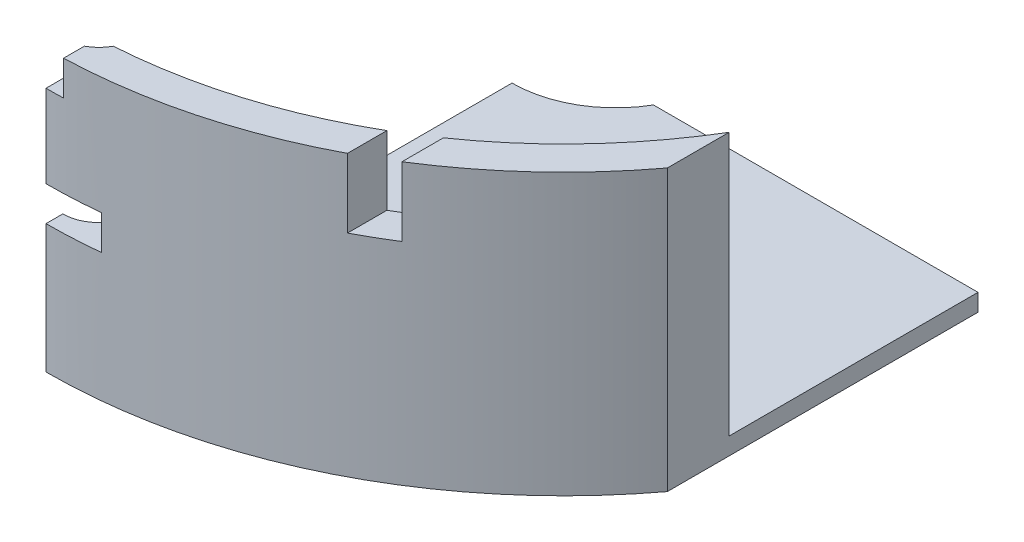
ISO-10303-21;
HEADER;
FILE_DESCRIPTION(('STEP AP214'),'2;1');
FILE_NAME('part.step','',(''),(''),'','','');
FILE_SCHEMA(('AUTOMOTIVE_DESIGN { 1 0 10303 214 1 1 1 1 }'));
ENDSEC;
DATA;
#1=APPLICATION_CONTEXT('core data for automotive mechanical design processes');
#2=APPLICATION_PROTOCOL_DEFINITION('international standard','automotive_design',2000,#1);
#3=PRODUCT_CONTEXT('',#1,'mechanical');
#4=PRODUCT('Part','Part','',(#3));
#5=PRODUCT_RELATED_PRODUCT_CATEGORY('part','',(#4));
#6=PRODUCT_DEFINITION_FORMATION('','',#4);
#7=PRODUCT_DEFINITION_CONTEXT('part definition',#1,'design');
#8=PRODUCT_DEFINITION('design','',#6,#7);
#9=PRODUCT_DEFINITION_SHAPE('','',#8);
#10=(LENGTH_UNIT() NAMED_UNIT(*) SI_UNIT(.MILLI.,.METRE.));
#11=(NAMED_UNIT(*) PLANE_ANGLE_UNIT() SI_UNIT($,.RADIAN.));
#12=(NAMED_UNIT(*) SI_UNIT($,.STERADIAN.) SOLID_ANGLE_UNIT());
#13=UNCERTAINTY_MEASURE_WITH_UNIT(LENGTH_MEASURE(1.E-05),#10,'distance_accuracy_value','');
#14=(GEOMETRIC_REPRESENTATION_CONTEXT(3) GLOBAL_UNCERTAINTY_ASSIGNED_CONTEXT((#13)) GLOBAL_UNIT_ASSIGNED_CONTEXT((#10,
#11,#12)) REPRESENTATION_CONTEXT('',''));
#15=CARTESIAN_POINT('',(0.,0.,0.));
#16=DIRECTION('',(0.,0.,1.));
#17=DIRECTION('',(1.,0.,0.));
#18=AXIS2_PLACEMENT_3D('',#15,#16,#17);
#19=CARTESIAN_POINT('',(0.,5.,0.));
#20=DIRECTION('',(0.,-1.,0.));
#21=DIRECTION('',(0.,0.,-1.));
#22=AXIS2_PLACEMENT_3D('',#19,#20,#21);
#23=CYLINDRICAL_SURFACE('',#22,150.);
#24=DIRECTION('',(0.,-1.,0.));
#25=VECTOR('',#24,1.);
#26=CARTESIAN_POINT('',(0.,5.,150.));
#27=LINE('',#26,#25);
#28=CARTESIAN_POINT('',(0.,0.,150.));
#29=VERTEX_POINT('',#28);
#30=CARTESIAN_POINT('',(0.,37.2404509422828,150.));
#31=VERTEX_POINT('',#30);
#32=EDGE_CURVE('E187',#29,#31,#27,.F.);
#33=ORIENTED_EDGE('',*,*,#32,.F.);
#34=CARTESIAN_POINT('',(0.,0.,0.));
#35=DIRECTION('',(0.,1.,0.));
#36=DIRECTION('',(0.,0.,1.));
#37=AXIS2_PLACEMENT_3D('',#34,#35,#36);
#38=CIRCLE('',#37,150.);
#39=CARTESIAN_POINT('',(120.,0.,89.9999999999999));
#40=VERTEX_POINT('',#39);
#41=EDGE_CURVE('E201',#29,#40,#38,.T.);
#42=ORIENTED_EDGE('',*,*,#41,.T.);
#43=DIRECTION('',(0.,1.,0.));
#44=VECTOR('',#43,1.);
#45=CARTESIAN_POINT('',(120.,-5.,89.9999999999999));
#46=LINE('',#45,#44);
#47=CARTESIAN_POINT('',(120.,81.2,89.9999999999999));
#48=VERTEX_POINT('',#47);
#49=EDGE_CURVE('E243',#40,#48,#46,.T.);
#50=ORIENTED_EDGE('',*,*,#49,.T.);
#51=CARTESIAN_POINT('',(0.,81.2,0.));
#52=DIRECTION('',(0.,1.,0.));
#53=DIRECTION('',(0.,0.,1.));
#54=AXIS2_PLACEMENT_3D('',#51,#52,#53);
#55=CIRCLE('',#54,150.);
#56=CARTESIAN_POINT('',(80.,81.2,126.885775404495));
#57=VERTEX_POINT('',#56);
#58=EDGE_CURVE('E323',#57,#48,#55,.T.);
#59=ORIENTED_EDGE('',*,*,#58,.F.);
#60=DIRECTION('',(0.,-1.,0.));
#61=VECTOR('',#60,1.);
#62=CARTESIAN_POINT('',(80.,4.99999999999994,126.885775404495));
#63=LINE('',#62,#61);
#64=CARTESIAN_POINT('',(80.,61.2,126.885775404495));
#65=VERTEX_POINT('',#64);
#66=EDGE_CURVE('E333',#65,#57,#63,.F.);
#67=ORIENTED_EDGE('',*,*,#66,.F.);
#68=CARTESIAN_POINT('',(0.,61.2,0.));
#69=DIRECTION('',(0.,1.,0.));
#70=DIRECTION('',(0.,0.,1.));
#71=AXIS2_PLACEMENT_3D('',#68,#69,#70);
#72=CIRCLE('',#71,150.);
#73=CARTESIAN_POINT('',(70.,61.2,132.664991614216));
#74=VERTEX_POINT('',#73);
#75=EDGE_CURVE('E335',#74,#65,#72,.T.);
#76=ORIENTED_EDGE('',*,*,#75,.F.);
#77=DIRECTION('',(0.,-1.,0.));
#78=VECTOR('',#77,1.);
#79=CARTESIAN_POINT('',(70.,5.,132.664991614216));
#80=LINE('',#79,#78);
#81=CARTESIAN_POINT('',(70.,81.2,132.664991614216));
#82=VERTEX_POINT('',#81);
#83=EDGE_CURVE('E336',#82,#74,#80,.T.);
#84=ORIENTED_EDGE('',*,*,#83,.F.);
#85=CARTESIAN_POINT('',(5.,81.2,149.916643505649));
#86=VERTEX_POINT('',#85);
#87=EDGE_CURVE('E324',#86,#82,#55,.T.);
#88=ORIENTED_EDGE('',*,*,#87,.F.);
#89=DIRECTION('',(0.,-1.,0.));
#90=VECTOR('',#89,1.);
#91=CARTESIAN_POINT('',(4.99999999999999,5.,149.916643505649));
#92=LINE('',#91,#90);
#93=CARTESIAN_POINT('',(5.,71.2,149.916643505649));
#94=VERTEX_POINT('',#93);
#95=EDGE_CURVE('E348',#94,#86,#92,.F.);
#96=ORIENTED_EDGE('',*,*,#95,.F.);
#97=CARTESIAN_POINT('',(0.,71.2,0.));
#98=DIRECTION('',(0.,1.,0.));
#99=DIRECTION('',(0.,0.,1.));
#100=AXIS2_PLACEMENT_3D('',#97,#98,#99);
#101=CIRCLE('',#100,150.);
#102=CARTESIAN_POINT('',(0.,71.2,150.));
#103=VERTEX_POINT('',#102);
#104=EDGE_CURVE('E350',#103,#94,#101,.T.);
#105=ORIENTED_EDGE('',*,*,#104,.F.);
#106=CARTESIAN_POINT('',(0.,47.2404509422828,150.));
#107=VERTEX_POINT('',#106);
#108=EDGE_CURVE('E207',#107,#103,#27,.F.);
#109=ORIENTED_EDGE('',*,*,#108,.F.);
#110=CARTESIAN_POINT('',(0.,47.2404509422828,0.));
#111=DIRECTION('',(0.,-1.,0.));
#112=DIRECTION('',(1.,0.,0.));
#113=AXIS2_PLACEMENT_3D('',#110,#111,#112);
#114=CIRCLE('',#113,150.);
#115=CARTESIAN_POINT('',(15.24,47.2404509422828,149.223799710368));
#116=VERTEX_POINT('',#115);
#117=EDGE_CURVE('E369',#116,#107,#114,.T.);
#118=ORIENTED_EDGE('',*,*,#117,.F.);
#119=DIRECTION('',(0.,-1.,0.));
#120=VECTOR('',#119,1.);
#121=CARTESIAN_POINT('',(15.24,5.,149.223799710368));
#122=LINE('',#121,#120);
#123=CARTESIAN_POINT('',(15.24,37.2404509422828,149.223799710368));
#124=VERTEX_POINT('',#123);
#125=EDGE_CURVE('E276',#124,#116,#122,.F.);
#126=ORIENTED_EDGE('',*,*,#125,.F.);
#127=CARTESIAN_POINT('',(0.,37.2404509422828,0.));
#128=DIRECTION('',(0.,1.,0.));
#129=DIRECTION('',(0.,0.,1.));
#130=AXIS2_PLACEMENT_3D('',#127,#128,#129);
#131=CIRCLE('',#130,150.);
#132=EDGE_CURVE('E204',#31,#124,#131,.T.);
#133=ORIENTED_EDGE('',*,*,#132,.F.);
#134=EDGE_LOOP('',(#33,#42,#50,#59,#67,#76,#84,#88,#96,#105,#109,#118,#126,#133));
#135=FACE_BOUND('',#134,.T.);
#136=ADVANCED_FACE('F36',(#135),#23,.T.);
#137=CARTESIAN_POINT('',(0.,-5.,134.640586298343));
#138=DIRECTION('',(0.,1.,0.));
#139=DIRECTION('',(0.,0.,1.));
#140=AXIS2_PLACEMENT_3D('',#137,#138,#139);
#141=CYLINDRICAL_SURFACE('',#140,10.5);
#142=DIRECTION('',(0.,1.,0.));
#143=VECTOR('',#142,1.);
#144=CARTESIAN_POINT('',(0.,-5.,145.140586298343));
#145=LINE('',#144,#143);
#146=CARTESIAN_POINT('',(0.,71.2,145.140586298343));
#147=VERTEX_POINT('',#146);
#148=CARTESIAN_POINT('',(0.,47.2404509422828,145.140586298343));
#149=VERTEX_POINT('',#148);
#150=EDGE_CURVE('E195',#147,#149,#145,.F.);
#151=ORIENTED_EDGE('',*,*,#150,.F.);
#152=CARTESIAN_POINT('',(0.,71.2,134.640586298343));
#153=DIRECTION('',(0.,1.,0.));
#154=DIRECTION('',(0.,0.,1.));
#155=AXIS2_PLACEMENT_3D('',#152,#153,#154);
#156=CIRCLE('',#155,10.5);
#157=CARTESIAN_POINT('',(5.,71.2,143.873678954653));
#158=VERTEX_POINT('',#157);
#159=EDGE_CURVE('E292',#158,#147,#156,.F.);
#160=ORIENTED_EDGE('',*,*,#159,.F.);
#161=DIRECTION('',(0.,1.,0.));
#162=VECTOR('',#161,1.);
#163=CARTESIAN_POINT('',(4.99999999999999,-5.,143.873678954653));
#164=LINE('',#163,#162);
#165=CARTESIAN_POINT('',(5.,81.2,143.873678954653));
#166=VERTEX_POINT('',#165);
#167=EDGE_CURVE('E346',#166,#158,#164,.F.);
#168=ORIENTED_EDGE('',*,*,#167,.F.);
#169=CARTESIAN_POINT('',(0.,81.2,134.640586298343));
#170=DIRECTION('',(0.,1.,0.));
#171=DIRECTION('',(0.,0.,1.));
#172=AXIS2_PLACEMENT_3D('',#169,#170,#171);
#173=CIRCLE('',#172,10.5);
#174=CARTESIAN_POINT('',(9.20218561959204,81.2,139.697243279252));
#175=VERTEX_POINT('',#174);
#176=EDGE_CURVE('E318',#175,#166,#173,.F.);
#177=ORIENTED_EDGE('',*,*,#176,.F.);
#178=DIRECTION('',(0.,-1.,0.));
#179=VECTOR('',#178,1.);
#180=CARTESIAN_POINT('',(9.20218561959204,81.2,139.697243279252));
#181=LINE('',#180,#179);
#182=CARTESIAN_POINT('',(9.20218561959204,47.2404509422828,139.697243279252));
#183=VERTEX_POINT('',#182);
#184=EDGE_CURVE('E267',#175,#183,#181,.T.);
#185=ORIENTED_EDGE('',*,*,#184,.T.);
#186=CARTESIAN_POINT('',(0.,47.2404509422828,134.640586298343));
#187=DIRECTION('',(0.,-1.,0.));
#188=DIRECTION('',(1.,0.,0.));
#189=AXIS2_PLACEMENT_3D('',#186,#187,#188);
#190=CIRCLE('',#189,10.5);
#191=EDGE_CURVE('E365',#149,#183,#190,.F.);
#192=ORIENTED_EDGE('',*,*,#191,.F.);
#193=EDGE_LOOP('',(#151,#160,#168,#177,#185,#192));
#194=FACE_BOUND('',#193,.T.);
#195=ADVANCED_FACE('F421',(#194),#141,.F.);
#196=DIRECTION('',(0.,1.,0.));
#197=VECTOR('',#196,1.);
#198=CARTESIAN_POINT('',(0.,-5.,145.140586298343));
#199=LINE('',#198,#197);
#200=CARTESIAN_POINT('',(0.,37.2404509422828,145.140586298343));
#201=VERTEX_POINT('',#200);
#202=CARTESIAN_POINT('',(0.,0.,145.140586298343));
#203=VERTEX_POINT('',#202);
#204=EDGE_CURVE('E190',#201,#203,#199,.F.);
#205=ORIENTED_EDGE('',*,*,#204,.F.);
#206=CARTESIAN_POINT('',(0.,37.2404509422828,134.640586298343));
#207=DIRECTION('',(0.,1.,0.));
#208=DIRECTION('',(0.,0.,1.));
#209=AXIS2_PLACEMENT_3D('',#206,#207,#208);
#210=CIRCLE('',#209,10.5);
#211=CARTESIAN_POINT('',(9.20218561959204,37.2404509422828,139.697243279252));
#212=VERTEX_POINT('',#211);
#213=EDGE_CURVE('E358',#212,#201,#210,.F.);
#214=ORIENTED_EDGE('',*,*,#213,.F.);
#215=CARTESIAN_POINT('',(9.20218561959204,5.,139.697243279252));
#216=VERTEX_POINT('',#215);
#217=EDGE_CURVE('E281',#212,#216,#181,.T.);
#218=ORIENTED_EDGE('',*,*,#217,.T.);
#219=CARTESIAN_POINT('',(0.,5.,134.640586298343));
#220=DIRECTION('',(0.,1.,0.));
#221=DIRECTION('',(0.,0.,1.));
#222=AXIS2_PLACEMENT_3D('',#219,#220,#221);
#223=CIRCLE('',#222,10.5);
#224=CARTESIAN_POINT('',(0.,5.,124.140586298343));
#225=VERTEX_POINT('',#224);
#226=EDGE_CURVE('E222',#216,#225,#223,.T.);
#227=ORIENTED_EDGE('',*,*,#226,.T.);
#228=DIRECTION('',(0.,1.,0.));
#229=VECTOR('',#228,1.);
#230=CARTESIAN_POINT('',(0.,-5.,124.140586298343));
#231=LINE('',#230,#229);
#232=CARTESIAN_POINT('',(0.,0.,124.140586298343));
#233=VERTEX_POINT('',#232);
#234=EDGE_CURVE('E398',#233,#225,#231,.T.);
#235=ORIENTED_EDGE('',*,*,#234,.F.);
#236=CARTESIAN_POINT('',(0.,0.,134.640586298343));
#237=DIRECTION('',(0.,1.,0.));
#238=DIRECTION('',(0.,0.,1.));
#239=AXIS2_PLACEMENT_3D('',#236,#237,#238);
#240=CIRCLE('',#239,10.5);
#241=EDGE_CURVE('E218',#203,#233,#240,.T.);
#242=ORIENTED_EDGE('',*,*,#241,.F.);
#243=EDGE_LOOP('',(#205,#214,#218,#227,#235,#242));
#244=FACE_BOUND('',#243,.T.);
#245=ADVANCED_FACE('F426',(#244),#141,.F.);
#246=CARTESIAN_POINT('',(0.,5.,0.));
#247=DIRECTION('',(0.,1.,0.));
#248=DIRECTION('',(0.,0.,1.));
#249=AXIS2_PLACEMENT_3D('',#246,#247,#248);
#250=PLANE('',#249);
#251=CARTESIAN_POINT('',(0.,5.,-15.0000000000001));
#252=DIRECTION('',(0.,1.,0.));
#253=DIRECTION('',(0.,0.,1.));
#254=AXIS2_PLACEMENT_3D('',#251,#252,#253);
#255=CIRCLE('',#254,30.);
#256=CARTESIAN_POINT('',(0.,5.,14.9999999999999));
#257=VERTEX_POINT('',#256);
#258=CARTESIAN_POINT('',(25.980762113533,5.,2.0122792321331E-13));
#259=VERTEX_POINT('',#258);
#260=EDGE_CURVE('E230',#257,#259,#255,.T.);
#261=ORIENTED_EDGE('',*,*,#260,.F.);
#262=DIRECTION('',(0.,0.,1.));
#263=VECTOR('',#262,1.);
#264=CARTESIAN_POINT('',(0.,5.,0.));
#265=LINE('',#264,#263);
#266=CARTESIAN_POINT('',(0.,5.,59.1405862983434));
#267=VERTEX_POINT('',#266);
#268=EDGE_CURVE('E391',#257,#267,#265,.T.);
#269=ORIENTED_EDGE('',*,*,#268,.T.);
#270=CARTESIAN_POINT('',(0.,5.,73.1405862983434));
#271=DIRECTION('',(0.,1.,0.));
#272=DIRECTION('',(0.,0.,1.));
#273=AXIS2_PLACEMENT_3D('',#270,#271,#272);
#274=CIRCLE('',#273,14.);
#275=CARTESIAN_POINT('',(0.,5.,87.1405862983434));
#276=VERTEX_POINT('',#275);
#277=EDGE_CURVE('E231',#276,#267,#274,.T.);
#278=ORIENTED_EDGE('',*,*,#277,.F.);
#279=EDGE_CURVE('E59',#276,#225,#265,.T.);
#280=ORIENTED_EDGE('',*,*,#279,.T.);
#281=ORIENTED_EDGE('',*,*,#226,.F.);
#282=CARTESIAN_POINT('',(0.,5.,0.));
#283=DIRECTION('',(0.,1.,0.));
#284=DIRECTION('',(0.,0.,1.));
#285=AXIS2_PLACEMENT_3D('',#282,#283,#284);
#286=CIRCLE('',#285,140.);
#287=CARTESIAN_POINT('',(120.,5.,72.1110255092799));
#288=VERTEX_POINT('',#287);
#289=EDGE_CURVE('E258',#216,#288,#286,.T.);
#290=ORIENTED_EDGE('',*,*,#289,.T.);
#291=DIRECTION('',(0.,0.,1.));
#292=VECTOR('',#291,1.);
#293=CARTESIAN_POINT('',(120.,5.,0.));
#294=LINE('',#293,#292);
#295=CARTESIAN_POINT('',(120.,5.,2.02066721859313E-13));
#296=VERTEX_POINT('',#295);
#297=EDGE_CURVE('E232',#296,#288,#294,.T.);
#298=ORIENTED_EDGE('',*,*,#297,.F.);
#299=DIRECTION('',(-1.,0.,0.));
#300=VECTOR('',#299,1.);
#301=CARTESIAN_POINT('',(0.,5.,2.02066721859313E-13));
#302=LINE('',#301,#300);
#303=EDGE_CURVE('E212',#296,#259,#302,.T.);
#304=ORIENTED_EDGE('',*,*,#303,.T.);
#305=EDGE_LOOP('',(#261,#269,#278,#280,#281,#290,#298,#304));
#306=FACE_BOUND('',#305,.T.);
#307=ADVANCED_FACE('F255',(#306),#250,.T.);
#308=CARTESIAN_POINT('',(0.,0.,0.));
#309=DIRECTION('',(0.,1.,0.));
#310=DIRECTION('',(0.,0.,1.));
#311=AXIS2_PLACEMENT_3D('',#308,#309,#310);
#312=PLANE('',#311);
#313=DIRECTION('',(0.,0.,-1.));
#314=VECTOR('',#313,1.);
#315=CARTESIAN_POINT('',(0.,0.,-5.03673116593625));
#316=LINE('',#315,#314);
#317=CARTESIAN_POINT('',(0.,0.,59.1405862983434));
#318=VERTEX_POINT('',#317);
#319=CARTESIAN_POINT('',(0.,0.,14.9999999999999));
#320=VERTEX_POINT('',#319);
#321=EDGE_CURVE('E51',#318,#320,#316,.T.);
#322=ORIENTED_EDGE('',*,*,#321,.T.);
#323=CARTESIAN_POINT('',(0.,0.,-15.0000000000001));
#324=DIRECTION('',(0.,1.,0.));
#325=DIRECTION('',(0.,0.,1.));
#326=AXIS2_PLACEMENT_3D('',#323,#324,#325);
#327=CIRCLE('',#326,30.);
#328=CARTESIAN_POINT('',(25.980762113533,0.,2.0122792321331E-13));
#329=VERTEX_POINT('',#328);
#330=EDGE_CURVE('E224',#320,#329,#327,.T.);
#331=ORIENTED_EDGE('',*,*,#330,.T.);
#332=DIRECTION('',(-1.,0.,0.));
#333=VECTOR('',#332,1.);
#334=CARTESIAN_POINT('',(0.,0.,2.02066721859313E-13));
#335=LINE('',#334,#333);
#336=CARTESIAN_POINT('',(120.,0.,2.02066721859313E-13));
#337=VERTEX_POINT('',#336);
#338=EDGE_CURVE('E213',#337,#329,#335,.T.);
#339=ORIENTED_EDGE('',*,*,#338,.F.);
#340=DIRECTION('',(0.,0.,1.));
#341=VECTOR('',#340,1.);
#342=CARTESIAN_POINT('',(120.,0.,0.));
#343=LINE('',#342,#341);
#344=EDGE_CURVE('E211',#337,#40,#343,.T.);
#345=ORIENTED_EDGE('',*,*,#344,.T.);
#346=ORIENTED_EDGE('',*,*,#41,.F.);
#347=EDGE_CURVE('E184',#29,#203,#316,.T.);
#348=ORIENTED_EDGE('',*,*,#347,.T.);
#349=ORIENTED_EDGE('',*,*,#241,.T.);
#350=CARTESIAN_POINT('',(0.,0.,87.1405862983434));
#351=VERTEX_POINT('',#350);
#352=EDGE_CURVE('E196',#233,#351,#316,.T.);
#353=ORIENTED_EDGE('',*,*,#352,.T.);
#354=CARTESIAN_POINT('',(0.,0.,73.1405862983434));
#355=DIRECTION('',(0.,1.,0.));
#356=DIRECTION('',(0.,0.,1.));
#357=AXIS2_PLACEMENT_3D('',#354,#355,#356);
#358=CIRCLE('',#357,14.);
#359=EDGE_CURVE('E227',#351,#318,#358,.T.);
#360=ORIENTED_EDGE('',*,*,#359,.T.);
#361=EDGE_LOOP('',(#322,#331,#339,#345,#346,#348,#349,#353,#360));
#362=FACE_BOUND('',#361,.T.);
#363=ADVANCED_FACE('F209',(#362),#312,.F.);
#364=CARTESIAN_POINT('',(0.,-5.,-15.0000000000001));
#365=DIRECTION('',(0.,1.,0.));
#366=DIRECTION('',(0.,0.,1.));
#367=AXIS2_PLACEMENT_3D('',#364,#365,#366);
#368=CYLINDRICAL_SURFACE('',#367,30.);
#369=DIRECTION('',(0.,1.,0.));
#370=VECTOR('',#369,1.);
#371=CARTESIAN_POINT('',(0.,-5.,14.9999999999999));
#372=LINE('',#371,#370);
#373=EDGE_CURVE('E394',#257,#320,#372,.F.);
#374=ORIENTED_EDGE('',*,*,#373,.F.);
#375=ORIENTED_EDGE('',*,*,#260,.T.);
#376=DIRECTION('',(0.,1.,0.));
#377=VECTOR('',#376,1.);
#378=CARTESIAN_POINT('',(25.980762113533,-5.,2.0122792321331E-13));
#379=LINE('',#378,#377);
#380=EDGE_CURVE('E237',#329,#259,#379,.T.);
#381=ORIENTED_EDGE('',*,*,#380,.F.);
#382=ORIENTED_EDGE('',*,*,#330,.F.);
#383=EDGE_LOOP('',(#374,#375,#381,#382));
#384=FACE_BOUND('',#383,.T.);
#385=ADVANCED_FACE('F432',(#384),#368,.F.);
#386=CARTESIAN_POINT('',(0.,-5.,73.1405862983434));
#387=DIRECTION('',(0.,1.,0.));
#388=DIRECTION('',(0.,0.,1.));
#389=AXIS2_PLACEMENT_3D('',#386,#387,#388);
#390=CYLINDRICAL_SURFACE('',#389,14.);
#391=DIRECTION('',(0.,1.,0.));
#392=VECTOR('',#391,1.);
#393=CARTESIAN_POINT('',(0.,-5.,87.1405862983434));
#394=LINE('',#393,#392);
#395=EDGE_CURVE('E396',#276,#351,#394,.F.);
#396=ORIENTED_EDGE('',*,*,#395,.F.);
#397=ORIENTED_EDGE('',*,*,#277,.T.);
#398=DIRECTION('',(0.,1.,0.));
#399=VECTOR('',#398,1.);
#400=CARTESIAN_POINT('',(0.,-5.,59.1405862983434));
#401=LINE('',#400,#399);
#402=EDGE_CURVE('E205',#318,#267,#401,.T.);
#403=ORIENTED_EDGE('',*,*,#402,.F.);
#404=ORIENTED_EDGE('',*,*,#359,.F.);
#405=EDGE_LOOP('',(#396,#397,#403,#404));
#406=FACE_BOUND('',#405,.T.);
#407=ADVANCED_FACE('F439',(#406),#390,.F.);
#408=CARTESIAN_POINT('',(0.,47.2404509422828,210.2));
#409=DIRECTION('',(0.,-1.,0.));
#410=DIRECTION('',(1.,0.,0.));
#411=AXIS2_PLACEMENT_3D('',#408,#409,#410);
#412=PLANE('',#411);
#413=ORIENTED_EDGE('',*,*,#117,.T.);
#414=DIRECTION('',(0.,0.,-1.));
#415=VECTOR('',#414,1.);
#416=CARTESIAN_POINT('',(0.,47.2404509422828,210.2));
#417=LINE('',#416,#415);
#418=EDGE_CURVE('E383',#107,#149,#417,.T.);
#419=ORIENTED_EDGE('',*,*,#418,.T.);
#420=ORIENTED_EDGE('',*,*,#191,.T.);
#421=CARTESIAN_POINT('',(0.,47.2404509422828,0.));
#422=DIRECTION('',(0.,-1.,0.));
#423=DIRECTION('',(1.,0.,0.));
#424=AXIS2_PLACEMENT_3D('',#421,#422,#423);
#425=CIRCLE('',#424,140.);
#426=CARTESIAN_POINT('',(15.24,47.2404509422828,139.168036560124));
#427=VERTEX_POINT('',#426);
#428=EDGE_CURVE('E367',#427,#183,#425,.T.);
#429=ORIENTED_EDGE('',*,*,#428,.F.);
#430=DIRECTION('',(0.,0.,-1.));
#431=VECTOR('',#430,1.);
#432=CARTESIAN_POINT('',(15.24,47.2404509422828,210.2));
#433=LINE('',#432,#431);
#434=EDGE_CURVE('E355',#116,#427,#433,.T.);
#435=ORIENTED_EDGE('',*,*,#434,.F.);
#436=EDGE_LOOP('',(#413,#419,#420,#429,#435));
#437=FACE_BOUND('',#436,.T.);
#438=ADVANCED_FACE('F378',(#437),#412,.T.);
#439=CARTESIAN_POINT('',(0.,37.2404509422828,210.2));
#440=DIRECTION('',(0.,1.,0.));
#441=DIRECTION('',(0.,0.,1.));
#442=AXIS2_PLACEMENT_3D('',#439,#440,#441);
#443=PLANE('',#442);
#444=ORIENTED_EDGE('',*,*,#213,.T.);
#445=DIRECTION('',(0.,0.,1.));
#446=VECTOR('',#445,1.);
#447=CARTESIAN_POINT('',(0.,37.2404509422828,210.2));
#448=LINE('',#447,#446);
#449=EDGE_CURVE('E384',#201,#31,#448,.T.);
#450=ORIENTED_EDGE('',*,*,#449,.T.);
#451=ORIENTED_EDGE('',*,*,#132,.T.);
#452=DIRECTION('',(0.,0.,-1.));
#453=VECTOR('',#452,1.);
#454=CARTESIAN_POINT('',(15.24,37.2404509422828,210.2));
#455=LINE('',#454,#453);
#456=CARTESIAN_POINT('',(15.24,37.2404509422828,139.168036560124));
#457=VERTEX_POINT('',#456);
#458=EDGE_CURVE('E352',#124,#457,#455,.T.);
#459=ORIENTED_EDGE('',*,*,#458,.T.);
#460=CARTESIAN_POINT('',(0.,37.2404509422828,0.));
#461=DIRECTION('',(0.,1.,0.));
#462=DIRECTION('',(0.,0.,1.));
#463=AXIS2_PLACEMENT_3D('',#460,#461,#462);
#464=CIRCLE('',#463,140.);
#465=EDGE_CURVE('E361',#212,#457,#464,.T.);
#466=ORIENTED_EDGE('',*,*,#465,.F.);
#467=EDGE_LOOP('',(#444,#450,#451,#459,#466));
#468=FACE_BOUND('',#467,.T.);
#469=ADVANCED_FACE('F453',(#468),#443,.T.);
#470=CARTESIAN_POINT('',(0.,71.2,210.2));
#471=DIRECTION('',(0.,1.,0.));
#472=DIRECTION('',(0.,0.,1.));
#473=AXIS2_PLACEMENT_3D('',#470,#471,#472);
#474=PLANE('',#473);
#475=ORIENTED_EDGE('',*,*,#159,.T.);
#476=DIRECTION('',(0.,0.,1.));
#477=VECTOR('',#476,1.);
#478=CARTESIAN_POINT('',(0.,71.2,210.2));
#479=LINE('',#478,#477);
#480=EDGE_CURVE('E11',#147,#103,#479,.T.);
#481=ORIENTED_EDGE('',*,*,#480,.T.);
#482=ORIENTED_EDGE('',*,*,#104,.T.);
#483=DIRECTION('',(0.,0.,-1.));
#484=VECTOR('',#483,1.);
#485=CARTESIAN_POINT('',(5.,71.2,210.2));
#486=LINE('',#485,#484);
#487=EDGE_CURVE('E338',#94,#158,#486,.T.);
#488=ORIENTED_EDGE('',*,*,#487,.T.);
#489=EDGE_LOOP('',(#475,#481,#482,#488));
#490=FACE_BOUND('',#489,.T.);
#491=ADVANCED_FACE('F448',(#490),#474,.T.);
#492=CARTESIAN_POINT('',(0.,81.2,0.));
#493=DIRECTION('',(0.,1.,0.));
#494=DIRECTION('',(0.,0.,1.));
#495=AXIS2_PLACEMENT_3D('',#492,#493,#494);
#496=PLANE('',#495);
#497=CARTESIAN_POINT('',(0.,81.2,0.));
#498=DIRECTION('',(0.,1.,0.));
#499=DIRECTION('',(0.,0.,1.));
#500=AXIS2_PLACEMENT_3D('',#497,#498,#499);
#501=CIRCLE('',#500,140.);
#502=CARTESIAN_POINT('',(80.,81.2,114.891252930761));
#503=VERTEX_POINT('',#502);
#504=CARTESIAN_POINT('',(120.,81.2,72.1110255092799));
#505=VERTEX_POINT('',#504);
#506=EDGE_CURVE('E275',#503,#505,#501,.T.);
#507=ORIENTED_EDGE('',*,*,#506,.F.);
#508=DIRECTION('',(0.,0.,-1.));
#509=VECTOR('',#508,1.);
#510=CARTESIAN_POINT('',(80.,81.2,210.2));
#511=LINE('',#510,#509);
#512=EDGE_CURVE('E312',#57,#503,#511,.T.);
#513=ORIENTED_EDGE('',*,*,#512,.F.);
#514=ORIENTED_EDGE('',*,*,#58,.T.);
#515=DIRECTION('',(0.,0.,-1.));
#516=VECTOR('',#515,1.);
#517=CARTESIAN_POINT('',(120.,81.2,0.));
#518=LINE('',#517,#516);
#519=EDGE_CURVE('E270',#48,#505,#518,.T.);
#520=ORIENTED_EDGE('',*,*,#519,.T.);
#521=EDGE_LOOP('',(#507,#513,#514,#520));
#522=FACE_BOUND('',#521,.T.);
#523=ADVANCED_FACE('F311',(#522),#496,.T.);
#524=ORIENTED_EDGE('',*,*,#87,.T.);
#525=DIRECTION('',(0.,0.,-1.));
#526=VECTOR('',#525,1.);
#527=CARTESIAN_POINT('',(70.,81.2,210.2));
#528=LINE('',#527,#526);
#529=CARTESIAN_POINT('',(70.,81.2,121.243556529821));
#530=VERTEX_POINT('',#529);
#531=EDGE_CURVE('E402',#82,#530,#528,.T.);
#532=ORIENTED_EDGE('',*,*,#531,.T.);
#533=EDGE_CURVE('E315',#175,#530,#501,.T.);
#534=ORIENTED_EDGE('',*,*,#533,.F.);
#535=ORIENTED_EDGE('',*,*,#176,.T.);
#536=DIRECTION('',(0.,0.,1.));
#537=VECTOR('',#536,1.);
#538=CARTESIAN_POINT('',(5.,81.2,0.));
#539=LINE('',#538,#537);
#540=EDGE_CURVE('E289',#166,#86,#539,.T.);
#541=ORIENTED_EDGE('',*,*,#540,.T.);
#542=EDGE_LOOP('',(#524,#532,#534,#535,#541));
#543=FACE_BOUND('',#542,.T.);
#544=ADVANCED_FACE('F445',(#543),#496,.T.);
#545=CARTESIAN_POINT('',(0.,81.2,0.));
#546=DIRECTION('',(0.,-1.,0.));
#547=DIRECTION('',(0.,0.,-1.));
#548=AXIS2_PLACEMENT_3D('',#545,#546,#547);
#549=CYLINDRICAL_SURFACE('',#548,140.);
#550=CARTESIAN_POINT('',(0.,61.2,0.));
#551=DIRECTION('',(0.,1.,0.));
#552=DIRECTION('',(0.,0.,1.));
#553=AXIS2_PLACEMENT_3D('',#550,#551,#552);
#554=CIRCLE('',#553,140.);
#555=CARTESIAN_POINT('',(70.,61.2,121.243556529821));
#556=VERTEX_POINT('',#555);
#557=CARTESIAN_POINT('',(80.,61.2,114.891252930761));
#558=VERTEX_POINT('',#557);
#559=EDGE_CURVE('E298',#556,#558,#554,.T.);
#560=ORIENTED_EDGE('',*,*,#559,.T.);
#561=DIRECTION('',(0.,-1.,0.));
#562=VECTOR('',#561,1.);
#563=CARTESIAN_POINT('',(80.,81.1999999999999,114.891252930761));
#564=LINE('',#563,#562);
#565=EDGE_CURVE('E44',#558,#503,#564,.F.);
#566=ORIENTED_EDGE('',*,*,#565,.T.);
#567=ORIENTED_EDGE('',*,*,#506,.T.);
#568=DIRECTION('',(0.,-1.,0.));
#569=VECTOR('',#568,1.);
#570=CARTESIAN_POINT('',(120.,81.2,72.1110255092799));
#571=LINE('',#570,#569);
#572=EDGE_CURVE('E286',#505,#288,#571,.T.);
#573=ORIENTED_EDGE('',*,*,#572,.T.);
#574=ORIENTED_EDGE('',*,*,#289,.F.);
#575=ORIENTED_EDGE('',*,*,#217,.F.);
#576=ORIENTED_EDGE('',*,*,#465,.T.);
#577=DIRECTION('',(0.,-1.,0.));
#578=VECTOR('',#577,1.);
#579=CARTESIAN_POINT('',(15.24,81.2,139.168036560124));
#580=LINE('',#579,#578);
#581=EDGE_CURVE('E226',#457,#427,#580,.F.);
#582=ORIENTED_EDGE('',*,*,#581,.T.);
#583=ORIENTED_EDGE('',*,*,#428,.T.);
#584=ORIENTED_EDGE('',*,*,#184,.F.);
#585=ORIENTED_EDGE('',*,*,#533,.T.);
#586=DIRECTION('',(0.,-1.,0.));
#587=VECTOR('',#586,1.);
#588=CARTESIAN_POINT('',(70.,81.2,121.243556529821));
#589=LINE('',#588,#587);
#590=EDGE_CURVE('E295',#530,#556,#589,.T.);
#591=ORIENTED_EDGE('',*,*,#590,.T.);
#592=EDGE_LOOP('',(#560,#566,#567,#573,#574,#575,#576,#582,#583,#584,#585,#591));
#593=FACE_BOUND('',#592,.T.);
#594=ADVANCED_FACE('F303',(#593),#549,.F.);
#595=CARTESIAN_POINT('',(0.,5.,2.02066721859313E-13));
#596=DIRECTION('',(0.,0.,1.));
#597=DIRECTION('',(1.,0.,0.));
#598=AXIS2_PLACEMENT_3D('',#595,#596,#597);
#599=PLANE('',#598);
#600=ORIENTED_EDGE('',*,*,#338,.T.);
#601=ORIENTED_EDGE('',*,*,#380,.T.);
#602=ORIENTED_EDGE('',*,*,#303,.F.);
#603=DIRECTION('',(0.,1.,0.));
#604=VECTOR('',#603,1.);
#605=CARTESIAN_POINT('',(120.,-5.,2.02066721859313E-13));
#606=LINE('',#605,#604);
#607=EDGE_CURVE('E236',#337,#296,#606,.T.);
#608=ORIENTED_EDGE('',*,*,#607,.F.);
#609=EDGE_LOOP('',(#600,#601,#602,#608));
#610=FACE_BOUND('',#609,.T.);
#611=ADVANCED_FACE('F38',(#610),#599,.F.);
#612=CARTESIAN_POINT('',(120.,-5.,0.));
#613=DIRECTION('',(-1.,0.,0.));
#614=DIRECTION('',(0.,0.,1.));
#615=AXIS2_PLACEMENT_3D('',#612,#613,#614);
#616=PLANE('',#615);
#617=ORIENTED_EDGE('',*,*,#607,.T.);
#618=ORIENTED_EDGE('',*,*,#297,.T.);
#619=ORIENTED_EDGE('',*,*,#572,.F.);
#620=ORIENTED_EDGE('',*,*,#519,.F.);
#621=ORIENTED_EDGE('',*,*,#49,.F.);
#622=ORIENTED_EDGE('',*,*,#344,.F.);
#623=EDGE_LOOP('',(#617,#618,#619,#620,#621,#622));
#624=FACE_BOUND('',#623,.T.);
#625=ADVANCED_FACE('F248',(#624),#616,.F.);
#626=CARTESIAN_POINT('',(15.24,0.,210.2));
#627=DIRECTION('',(-1.,0.,0.));
#628=DIRECTION('',(0.,0.,1.));
#629=AXIS2_PLACEMENT_3D('',#626,#627,#628);
#630=PLANE('',#629);
#631=ORIENTED_EDGE('',*,*,#125,.T.);
#632=ORIENTED_EDGE('',*,*,#434,.T.);
#633=ORIENTED_EDGE('',*,*,#581,.F.);
#634=ORIENTED_EDGE('',*,*,#458,.F.);
#635=EDGE_LOOP('',(#631,#632,#633,#634));
#636=FACE_BOUND('',#635,.T.);
#637=ADVANCED_FACE('F377',(#636),#630,.T.);
#638=CARTESIAN_POINT('',(4.99999999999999,0.,210.2));
#639=DIRECTION('',(-1.,0.,0.));
#640=DIRECTION('',(0.,-1.,0.));
#641=AXIS2_PLACEMENT_3D('',#638,#639,#640);
#642=PLANE('',#641);
#643=ORIENTED_EDGE('',*,*,#95,.T.);
#644=ORIENTED_EDGE('',*,*,#540,.F.);
#645=ORIENTED_EDGE('',*,*,#167,.T.);
#646=ORIENTED_EDGE('',*,*,#487,.F.);
#647=EDGE_LOOP('',(#643,#644,#645,#646));
#648=FACE_BOUND('',#647,.T.);
#649=ADVANCED_FACE('F418',(#648),#642,.T.);
#650=CARTESIAN_POINT('',(0.,61.2,210.2));
#651=DIRECTION('',(0.,1.,0.));
#652=DIRECTION('',(0.,0.,1.));
#653=AXIS2_PLACEMENT_3D('',#650,#651,#652);
#654=PLANE('',#653);
#655=ORIENTED_EDGE('',*,*,#75,.T.);
#656=DIRECTION('',(0.,0.,-1.));
#657=VECTOR('',#656,1.);
#658=CARTESIAN_POINT('',(80.,61.2,210.2));
#659=LINE('',#658,#657);
#660=EDGE_CURVE('E340',#65,#558,#659,.T.);
#661=ORIENTED_EDGE('',*,*,#660,.T.);
#662=ORIENTED_EDGE('',*,*,#559,.F.);
#663=DIRECTION('',(0.,0.,-1.));
#664=VECTOR('',#663,1.);
#665=CARTESIAN_POINT('',(70.,61.2,210.2));
#666=LINE('',#665,#664);
#667=EDGE_CURVE('E400',#74,#556,#666,.T.);
#668=ORIENTED_EDGE('',*,*,#667,.F.);
#669=EDGE_LOOP('',(#655,#661,#662,#668));
#670=FACE_BOUND('',#669,.T.);
#671=ADVANCED_FACE('F405',(#670),#654,.T.);
#672=CARTESIAN_POINT('',(80.,0.,210.2));
#673=DIRECTION('',(-1.,0.,0.));
#674=DIRECTION('',(0.,-1.,0.));
#675=AXIS2_PLACEMENT_3D('',#672,#673,#674);
#676=PLANE('',#675);
#677=ORIENTED_EDGE('',*,*,#66,.T.);
#678=ORIENTED_EDGE('',*,*,#512,.T.);
#679=ORIENTED_EDGE('',*,*,#565,.F.);
#680=ORIENTED_EDGE('',*,*,#660,.F.);
#681=EDGE_LOOP('',(#677,#678,#679,#680));
#682=FACE_BOUND('',#681,.T.);
#683=ADVANCED_FACE('F407',(#682),#676,.T.);
#684=CARTESIAN_POINT('',(70.,0.,210.2));
#685=DIRECTION('',(1.,0.,0.));
#686=DIRECTION('',(0.,0.,-1.));
#687=AXIS2_PLACEMENT_3D('',#684,#685,#686);
#688=PLANE('',#687);
#689=ORIENTED_EDGE('',*,*,#83,.T.);
#690=ORIENTED_EDGE('',*,*,#667,.T.);
#691=ORIENTED_EDGE('',*,*,#590,.F.);
#692=ORIENTED_EDGE('',*,*,#531,.F.);
#693=EDGE_LOOP('',(#689,#690,#691,#692));
#694=FACE_BOUND('',#693,.T.);
#695=ADVANCED_FACE('F409',(#694),#688,.T.);
#696=CARTESIAN_POINT('',(0.,114.,-5.03673116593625));
#697=DIRECTION('',(-1.,0.,0.));
#698=DIRECTION('',(0.,0.,1.));
#699=AXIS2_PLACEMENT_3D('',#696,#697,#698);
#700=PLANE('',#699);
#701=ORIENTED_EDGE('',*,*,#108,.T.);
#702=ORIENTED_EDGE('',*,*,#480,.F.);
#703=ORIENTED_EDGE('',*,*,#150,.T.);
#704=ORIENTED_EDGE('',*,*,#418,.F.);
#705=EDGE_LOOP('',(#701,#702,#703,#704));
#706=FACE_BOUND('',#705,.T.);
#707=ADVANCED_FACE('F415',(#706),#700,.T.);
#708=ORIENTED_EDGE('',*,*,#32,.T.);
#709=ORIENTED_EDGE('',*,*,#449,.F.);
#710=ORIENTED_EDGE('',*,*,#204,.T.);
#711=ORIENTED_EDGE('',*,*,#347,.F.);
#712=EDGE_LOOP('',(#708,#709,#710,#711));
#713=FACE_BOUND('',#712,.T.);
#714=ADVANCED_FACE('F186',(#713),#700,.T.);
#715=ORIENTED_EDGE('',*,*,#373,.T.);
#716=ORIENTED_EDGE('',*,*,#321,.F.);
#717=ORIENTED_EDGE('',*,*,#402,.T.);
#718=ORIENTED_EDGE('',*,*,#268,.F.);
#719=EDGE_LOOP('',(#715,#716,#717,#718));
#720=FACE_BOUND('',#719,.T.);
#721=ADVANCED_FACE('F478',(#720),#700,.T.);
#722=ORIENTED_EDGE('',*,*,#234,.T.);
#723=ORIENTED_EDGE('',*,*,#279,.F.);
#724=ORIENTED_EDGE('',*,*,#395,.T.);
#725=ORIENTED_EDGE('',*,*,#352,.F.);
#726=EDGE_LOOP('',(#722,#723,#724,#725));
#727=FACE_BOUND('',#726,.T.);
#728=ADVANCED_FACE('F473',(#727),#700,.T.);
#729=CLOSED_SHELL('',(#136,#195,#245,#307,#363,#385,#407,#438,#469,#491,#523,#544,#594,#611,
#625,#637,#649,#671,#683,#695,#707,#714,#721,#728));
#730=MANIFOLD_SOLID_BREP('B2',#729);
#731=ADVANCED_BREP_SHAPE_REPRESENTATION('',(#18,#730),#14);
#732=SHAPE_DEFINITION_REPRESENTATION(#9,#731);
ENDSEC;
END-ISO-10303-21;
